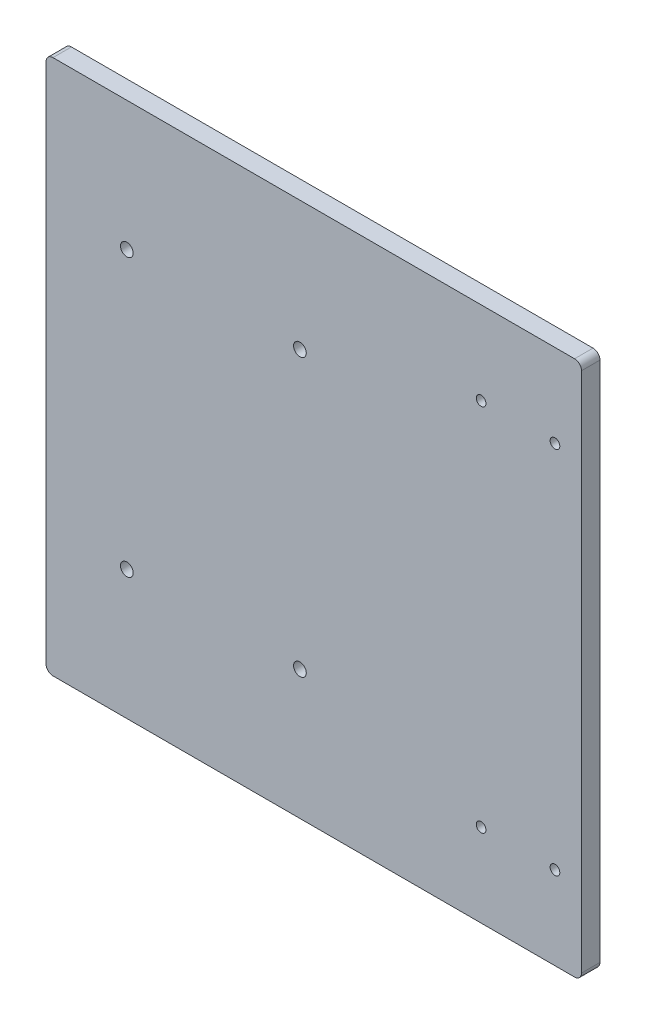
from build123d import *

# Parameters (mm, degrees)
SZKIC1_W                                             = 232
SZKIC1_H                                             = 232
DODANIE_WYCI_GNI_CIE1_DEPTH                          = 8
POG_BIENIE_STO_KOWE_POD_M5_WKR_T_DO_CZ_C_D           = 5.5
POG_BIENIE_STO_KOWE_POD_M5_WKR_T_DO_CZ_C_CSINK_D     = 10.4
POG_BIENIE_STO_KOWE_POD_M5_WKR_T_DO_CZ_C_CSINK_ANGLE = 90
OTW_R_GWINTOWANY_M5X0_81_D                           = 4.2
ZAOKR_GLENIE1_R                                      = 3


with BuildPart() as part:
    # Szkic1 → Dodanie-wyci_gni_cie1 (new body)
    with BuildSketch(Plane.XY):
        with Locations((116, 116)):
            Rectangle(SZKIC1_W, SZKIC1_H)
    extrude(amount=DODANIE_WYCI_GNI_CIE1_DEPTH)

    # Pog_bienie sto_kowe pod M5 wkr_t do cz_c (through all)
    with Locations(Plane(origin=(0, 0, 0), x_dir=(-1, 0, 0), z_dir=(0, 0, -1))):
        with Locations((-35, 56), (-35, 176), (-110, 56), (-110, 176)):
            CounterSinkHole(POG_BIENIE_STO_KOWE_POD_M5_WKR_T_DO_CZ_C_D / 2, POG_BIENIE_STO_KOWE_POD_M5_WKR_T_DO_CZ_C_CSINK_D / 2, counter_sink_angle=POG_BIENIE_STO_KOWE_POD_M5_WKR_T_DO_CZ_C_CSINK_ANGLE)

    # Otw_r gwintowany M5x0.81 (through all)
    with Locations(Plane.XY.offset(8)):
        with Locations((220.5, 196), (220.5, 36), (188.5, 36), (188.5, 196)):
            Hole(OTW_R_GWINTOWANY_M5X0_81_D / 2)

    # Zaokr_glenie1
    zaokr_glenie1_edges = [part.edges().sort_by_distance(p)[0] for p in [
        (0, 232, 4),
        (232, 232, 4),
        (232, 0, 4),
        (0, 0, 4),
    ]]
    fillet(zaokr_glenie1_edges, radius=ZAOKR_GLENIE1_R)


solid = part.part
